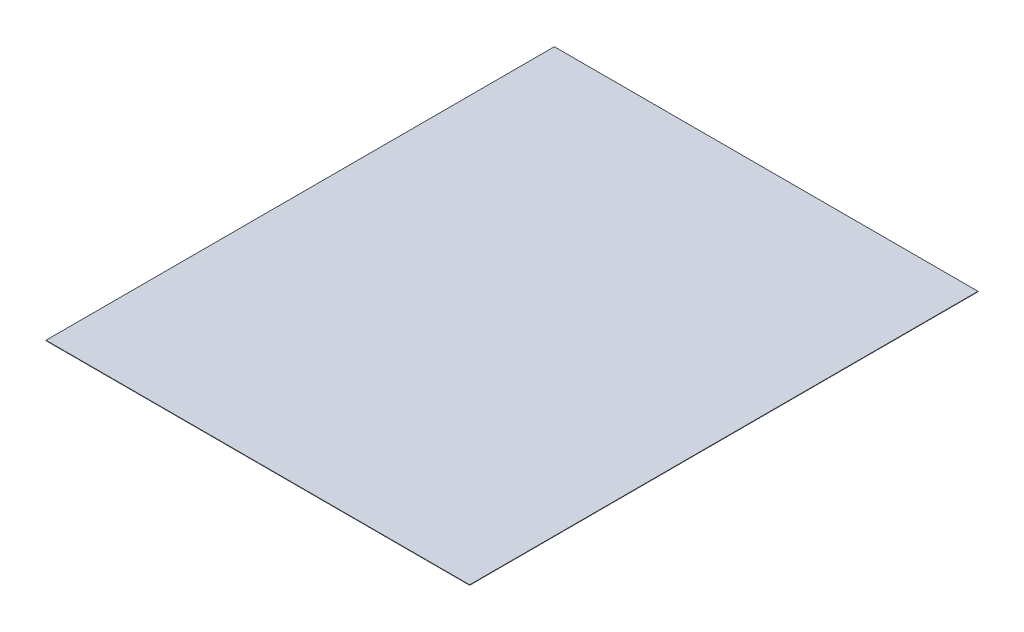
from build123d import *

# Parameters (mm, degrees)
SKETCH1_W           = 25400
SKETCH1_H           = 30480
BOSS_EXTRUDE1_DEPTH = 25.4


with BuildPart() as part:
    # Sketch1 → Boss-Extrude1 (new body)
    with BuildSketch(Plane(origin=(0, 0, 0), x_dir=(1, 0, 0), z_dir=(0, 1, 0))):
        Rectangle(SKETCH1_W, SKETCH1_H)
    extrude(amount=BOSS_EXTRUDE1_DEPTH)


solid = part.part
